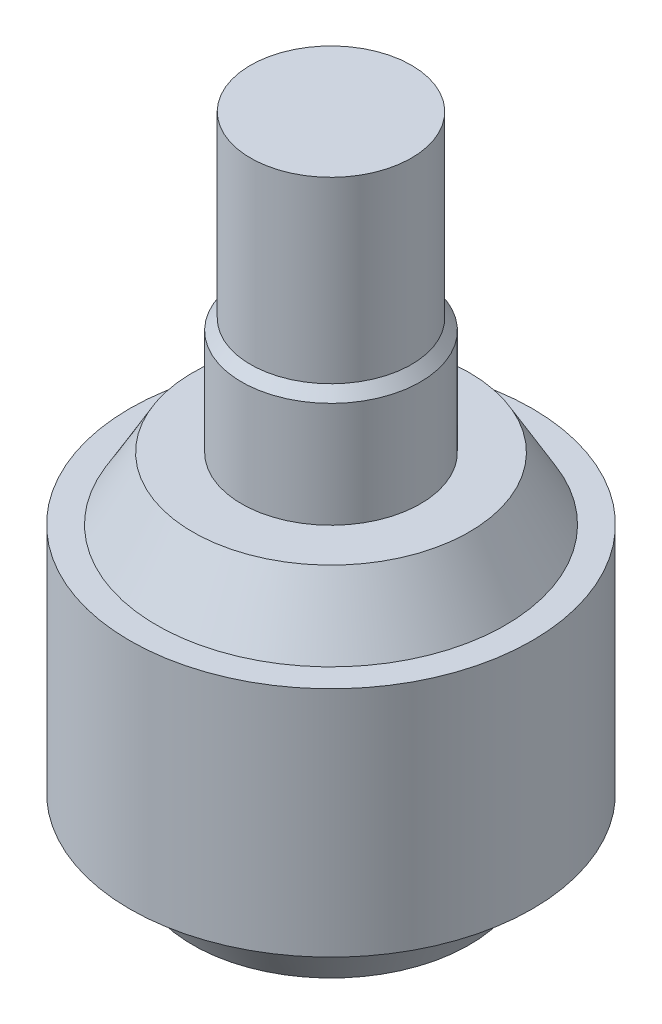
from build123d import *


with BuildPart() as part:
    # Sketch1 → Revolve1 (revolve)
    with BuildSketch(Plane.XY, mode=Mode.PRIVATE) as revolve1_sk:
        Polygon((0, 0), (1.545854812, 0), (1.95, 0.7), (2.25, 0.7), (2.25, 3.3), (1.95, 3.3), (1.545854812, 4), (1, 4), (1, 5.180824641), (0.9, 5.3), (0.9, 7.3), (0, 7.3), align=None)
    revolve(revolve1_sk.sketch.rotate(Axis((0, 0, 0), (0, 1, 0)), 90), axis=Axis((0, 0, 0), (0, 1, 0)))


solid = part.part
